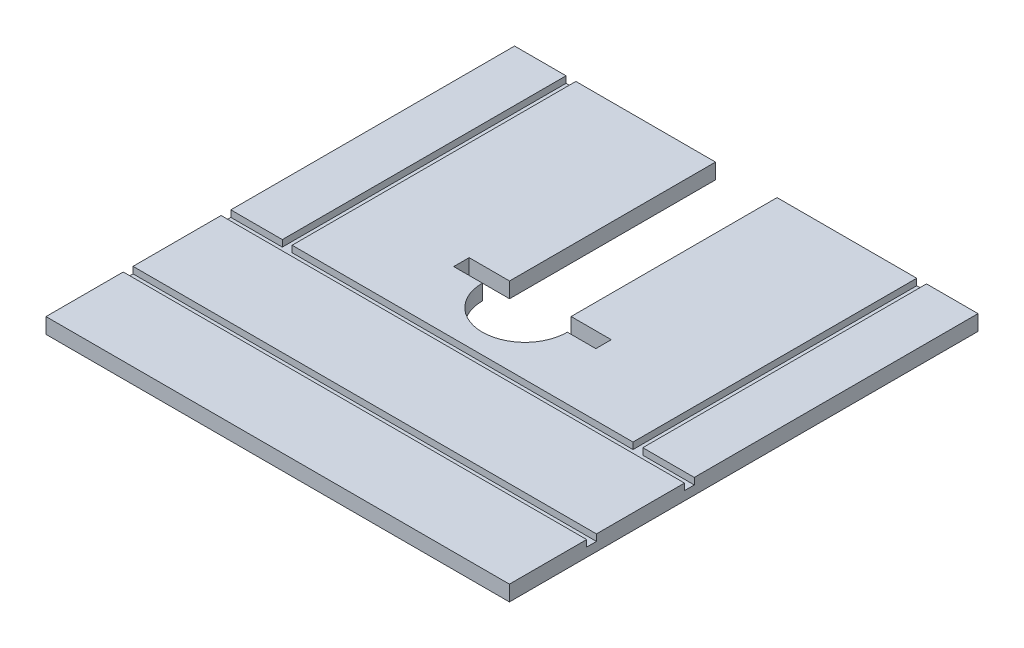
ISO-10303-21;
HEADER;
FILE_DESCRIPTION(('STEP AP214'),'2;1');
FILE_NAME('part.step','',(''),(''),'','','');
FILE_SCHEMA(('AUTOMOTIVE_DESIGN { 1 0 10303 214 1 1 1 1 }'));
ENDSEC;
DATA;
#1=APPLICATION_CONTEXT('core data for automotive mechanical design processes');
#2=APPLICATION_PROTOCOL_DEFINITION('international standard','automotive_design',2000,#1);
#3=PRODUCT_CONTEXT('',#1,'mechanical');
#4=PRODUCT('Part','Part','',(#3));
#5=PRODUCT_RELATED_PRODUCT_CATEGORY('part','',(#4));
#6=PRODUCT_DEFINITION_FORMATION('','',#4);
#7=PRODUCT_DEFINITION_CONTEXT('part definition',#1,'design');
#8=PRODUCT_DEFINITION('design','',#6,#7);
#9=PRODUCT_DEFINITION_SHAPE('','',#8);
#10=(LENGTH_UNIT() NAMED_UNIT(*) SI_UNIT(.MILLI.,.METRE.));
#11=(NAMED_UNIT(*) PLANE_ANGLE_UNIT() SI_UNIT($,.RADIAN.));
#12=(NAMED_UNIT(*) SI_UNIT($,.STERADIAN.) SOLID_ANGLE_UNIT());
#13=UNCERTAINTY_MEASURE_WITH_UNIT(LENGTH_MEASURE(1.E-05),#10,'distance_accuracy_value','');
#14=(GEOMETRIC_REPRESENTATION_CONTEXT(3) GLOBAL_UNCERTAINTY_ASSIGNED_CONTEXT((#13)) GLOBAL_UNIT_ASSIGNED_CONTEXT((#10,
#11,#12)) REPRESENTATION_CONTEXT('',''));
#15=CARTESIAN_POINT('',(0.,0.,0.));
#16=DIRECTION('',(0.,0.,1.));
#17=DIRECTION('',(1.,0.,0.));
#18=AXIS2_PLACEMENT_3D('',#15,#16,#17);
#19=CARTESIAN_POINT('',(0.,30.,0.));
#20=DIRECTION('',(0.,1.,0.));
#21=DIRECTION('',(0.,0.,1.));
#22=AXIS2_PLACEMENT_3D('',#19,#20,#21);
#23=PLANE('',#22);
#24=DIRECTION('',(-1.,0.,0.));
#25=VECTOR('',#24,1.);
#26=CARTESIAN_POINT('',(-450.,30.,121.));
#27=LINE('',#26,#25);
#28=CARTESIAN_POINT('',(-350.,30.,121.));
#29=VERTEX_POINT('',#28);
#30=CARTESIAN_POINT('',(-450.,30.,121.));
#31=VERTEX_POINT('',#30);
#32=EDGE_CURVE('E251',#29,#31,#27,.T.);
#33=ORIENTED_EDGE('',*,*,#32,.F.);
#34=DIRECTION('',(0.,0.,1.));
#35=VECTOR('',#34,1.);
#36=CARTESIAN_POINT('',(-350.,30.,-430.000000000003));
#37=LINE('',#36,#35);
#38=CARTESIAN_POINT('',(-350.,30.,-430.000000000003));
#39=VERTEX_POINT('',#38);
#40=EDGE_CURVE('E484',#39,#29,#37,.T.);
#41=ORIENTED_EDGE('',*,*,#40,.F.);
#42=DIRECTION('',(-1.,0.,0.));
#43=VECTOR('',#42,1.);
#44=CARTESIAN_POINT('',(-59.7765821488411,30.,-430.000000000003));
#45=LINE('',#44,#43);
#46=CARTESIAN_POINT('',(-450.,30.,-430.000000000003));
#47=VERTEX_POINT('',#46);
#48=EDGE_CURVE('E322',#39,#47,#45,.T.);
#49=ORIENTED_EDGE('',*,*,#48,.T.);
#50=DIRECTION('',(0.,0.,1.));
#51=VECTOR('',#50,1.);
#52=CARTESIAN_POINT('',(-450.,30.,-430.000000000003));
#53=LINE('',#52,#51);
#54=EDGE_CURVE('E289',#47,#31,#53,.T.);
#55=ORIENTED_EDGE('',*,*,#54,.T.);
#56=EDGE_LOOP('',(#33,#41,#49,#55));
#57=FACE_BOUND('',#56,.T.);
#58=ADVANCED_FACE('F32',(#57),#23,.T.);
#59=DIRECTION('',(0.,0.,-1.));
#60=VECTOR('',#59,1.);
#61=CARTESIAN_POINT('',(-331.,30.,121.));
#62=LINE('',#61,#60);
#63=CARTESIAN_POINT('',(-331.,30.,121.));
#64=VERTEX_POINT('',#63);
#65=CARTESIAN_POINT('',(-331.,30.,-430.000000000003));
#66=VERTEX_POINT('',#65);
#67=EDGE_CURVE('E482',#64,#66,#62,.T.);
#68=ORIENTED_EDGE('',*,*,#67,.F.);
#69=DIRECTION('',(-1.,0.,0.));
#70=VECTOR('',#69,1.);
#71=CARTESIAN_POINT('',(-331.,30.,121.));
#72=LINE('',#71,#70);
#73=CARTESIAN_POINT('',(331.,30.,121.));
#74=VERTEX_POINT('',#73);
#75=EDGE_CURVE('E479',#74,#64,#72,.T.);
#76=ORIENTED_EDGE('',*,*,#75,.F.);
#77=DIRECTION('',(0.,0.,1.));
#78=VECTOR('',#77,1.);
#79=CARTESIAN_POINT('',(331.,30.,121.));
#80=LINE('',#79,#78);
#81=CARTESIAN_POINT('',(331.,30.,-430.000000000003));
#82=VERTEX_POINT('',#81);
#83=EDGE_CURVE('E422',#82,#74,#80,.T.);
#84=ORIENTED_EDGE('',*,*,#83,.F.);
#85=DIRECTION('',(-1.,0.,0.));
#86=VECTOR('',#85,1.);
#87=CARTESIAN_POINT('',(450.,30.,-430.000000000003));
#88=LINE('',#87,#86);
#89=CARTESIAN_POINT('',(59.776582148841,30.,-430.000000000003));
#90=VERTEX_POINT('',#89);
#91=EDGE_CURVE('E299',#82,#90,#88,.T.);
#92=ORIENTED_EDGE('',*,*,#91,.T.);
#93=DIRECTION('',(0.,0.,1.));
#94=VECTOR('',#93,1.);
#95=CARTESIAN_POINT('',(59.776582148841,30.,-430.000000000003));
#96=LINE('',#95,#94);
#97=CARTESIAN_POINT('',(59.776582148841,30.,-30.000000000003));
#98=VERTEX_POINT('',#97);
#99=EDGE_CURVE('E304',#90,#98,#96,.T.);
#100=ORIENTED_EDGE('',*,*,#99,.T.);
#101=DIRECTION('',(1.,0.,0.));
#102=VECTOR('',#101,1.);
#103=CARTESIAN_POINT('',(59.776582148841,30.,-30.000000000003));
#104=LINE('',#103,#102);
#105=CARTESIAN_POINT('',(137.776582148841,30.,-30.000000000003));
#106=VERTEX_POINT('',#105);
#107=EDGE_CURVE('E306',#98,#106,#104,.T.);
#108=ORIENTED_EDGE('',*,*,#107,.T.);
#109=DIRECTION('',(0.,0.,1.));
#110=VECTOR('',#109,1.);
#111=CARTESIAN_POINT('',(137.776582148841,30.,-30.000000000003));
#112=LINE('',#111,#110);
#113=CARTESIAN_POINT('',(137.776582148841,30.,0.));
#114=VERTEX_POINT('',#113);
#115=EDGE_CURVE('E308',#106,#114,#112,.T.);
#116=ORIENTED_EDGE('',*,*,#115,.T.);
#117=DIRECTION('',(-1.,0.,0.));
#118=VECTOR('',#117,1.);
#119=CARTESIAN_POINT('',(137.776582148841,30.,0.));
#120=LINE('',#119,#118);
#121=CARTESIAN_POINT('',(82.5,30.,0.));
#122=VERTEX_POINT('',#121);
#123=EDGE_CURVE('E310',#114,#122,#120,.T.);
#124=ORIENTED_EDGE('',*,*,#123,.T.);
#125=CARTESIAN_POINT('',(0.,30.,0.));
#126=DIRECTION('',(0.,-1.,0.));
#127=DIRECTION('',(0.,0.,1.));
#128=AXIS2_PLACEMENT_3D('',#125,#126,#127);
#129=CIRCLE('',#128,82.5);
#130=CARTESIAN_POINT('',(-82.5,30.,0.));
#131=VERTEX_POINT('',#130);
#132=EDGE_CURVE('E312',#122,#131,#129,.T.);
#133=ORIENTED_EDGE('',*,*,#132,.T.);
#134=DIRECTION('',(-1.,0.,0.));
#135=VECTOR('',#134,1.);
#136=CARTESIAN_POINT('',(-138.223417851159,30.,0.));
#137=LINE('',#136,#135);
#138=CARTESIAN_POINT('',(-138.223417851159,30.,0.));
#139=VERTEX_POINT('',#138);
#140=EDGE_CURVE('E314',#131,#139,#137,.T.);
#141=ORIENTED_EDGE('',*,*,#140,.T.);
#142=DIRECTION('',(0.,0.,-1.));
#143=VECTOR('',#142,1.);
#144=CARTESIAN_POINT('',(-138.223417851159,30.,-30.000000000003));
#145=LINE('',#144,#143);
#146=CARTESIAN_POINT('',(-138.223417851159,30.,-30.000000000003));
#147=VERTEX_POINT('',#146);
#148=EDGE_CURVE('E316',#139,#147,#145,.T.);
#149=ORIENTED_EDGE('',*,*,#148,.T.);
#150=DIRECTION('',(1.,0.,0.));
#151=VECTOR('',#150,1.);
#152=CARTESIAN_POINT('',(-59.776582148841,30.,-30.0000000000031));
#153=LINE('',#152,#151);
#154=CARTESIAN_POINT('',(-59.776582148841,30.,-30.0000000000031));
#155=VERTEX_POINT('',#154);
#156=EDGE_CURVE('E318',#147,#155,#153,.T.);
#157=ORIENTED_EDGE('',*,*,#156,.T.);
#158=DIRECTION('',(0.,0.,-1.));
#159=VECTOR('',#158,1.);
#160=CARTESIAN_POINT('',(-59.7765821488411,30.,-430.000000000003));
#161=LINE('',#160,#159);
#162=CARTESIAN_POINT('',(-59.7765821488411,30.,-430.000000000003));
#163=VERTEX_POINT('',#162);
#164=EDGE_CURVE('E320',#155,#163,#161,.T.);
#165=ORIENTED_EDGE('',*,*,#164,.T.);
#166=EDGE_CURVE('E323',#163,#66,#45,.T.);
#167=ORIENTED_EDGE('',*,*,#166,.T.);
#168=EDGE_LOOP('',(#68,#76,#84,#92,#100,#108,#116,#124,#133,#141,#149,#157,#165,#167));
#169=FACE_BOUND('',#168,.T.);
#170=ADVANCED_FACE('F417',(#169),#23,.T.);
#171=DIRECTION('',(0.,0.,-1.));
#172=VECTOR('',#171,1.);
#173=CARTESIAN_POINT('',(350.,30.,-430.000000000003));
#174=LINE('',#173,#172);
#175=CARTESIAN_POINT('',(350.,30.,121.));
#176=VERTEX_POINT('',#175);
#177=CARTESIAN_POINT('',(350.,30.,-430.000000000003));
#178=VERTEX_POINT('',#177);
#179=EDGE_CURVE('E450',#176,#178,#174,.T.);
#180=ORIENTED_EDGE('',*,*,#179,.F.);
#181=DIRECTION('',(-1.,0.,0.));
#182=VECTOR('',#181,1.);
#183=CARTESIAN_POINT('',(350.,30.,121.));
#184=LINE('',#183,#182);
#185=CARTESIAN_POINT('',(450.,30.,121.));
#186=VERTEX_POINT('',#185);
#187=EDGE_CURVE('E444',#186,#176,#184,.T.);
#188=ORIENTED_EDGE('',*,*,#187,.F.);
#189=DIRECTION('',(0.,0.,-1.));
#190=VECTOR('',#189,1.);
#191=CARTESIAN_POINT('',(450.,30.,-430.000000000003));
#192=LINE('',#191,#190);
#193=CARTESIAN_POINT('',(450.,30.,-430.000000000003));
#194=VERTEX_POINT('',#193);
#195=EDGE_CURVE('E295',#186,#194,#192,.T.);
#196=ORIENTED_EDGE('',*,*,#195,.T.);
#197=EDGE_CURVE('E301',#194,#178,#88,.T.);
#198=ORIENTED_EDGE('',*,*,#197,.T.);
#199=EDGE_LOOP('',(#180,#188,#196,#198));
#200=FACE_BOUND('',#199,.T.);
#201=ADVANCED_FACE('F449',(#200),#23,.T.);
#202=DIRECTION('',(1.,0.,0.));
#203=VECTOR('',#202,1.);
#204=CARTESIAN_POINT('',(450.,30.,140.));
#205=LINE('',#204,#203);
#206=CARTESIAN_POINT('',(-450.,30.,140.));
#207=VERTEX_POINT('',#206);
#208=CARTESIAN_POINT('',(450.,30.,140.));
#209=VERTEX_POINT('',#208);
#210=EDGE_CURVE('E451',#207,#209,#205,.T.);
#211=ORIENTED_EDGE('',*,*,#210,.F.);
#212=CARTESIAN_POINT('',(-450.,30.,311.));
#213=VERTEX_POINT('',#212);
#214=EDGE_CURVE('E255',#207,#213,#53,.T.);
#215=ORIENTED_EDGE('',*,*,#214,.T.);
#216=DIRECTION('',(-1.,0.,0.));
#217=VECTOR('',#216,1.);
#218=CARTESIAN_POINT('',(-450.,30.,311.));
#219=LINE('',#218,#217);
#220=CARTESIAN_POINT('',(450.,30.,311.));
#221=VERTEX_POINT('',#220);
#222=EDGE_CURVE('E267',#221,#213,#219,.T.);
#223=ORIENTED_EDGE('',*,*,#222,.F.);
#224=EDGE_CURVE('E300',#221,#209,#192,.T.);
#225=ORIENTED_EDGE('',*,*,#224,.T.);
#226=EDGE_LOOP('',(#211,#215,#223,#225));
#227=FACE_BOUND('',#226,.T.);
#228=ADVANCED_FACE('F457',(#227),#23,.T.);
#229=CARTESIAN_POINT('',(-450.,30.,-430.000000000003));
#230=DIRECTION('',(1.,0.,0.));
#231=DIRECTION('',(0.,0.,-1.));
#232=AXIS2_PLACEMENT_3D('',#229,#230,#231);
#233=PLANE('',#232);
#234=DIRECTION('',(0.,0.,1.));
#235=VECTOR('',#234,1.);
#236=CARTESIAN_POINT('',(-450.,17.3,140.));
#237=LINE('',#236,#235);
#238=CARTESIAN_POINT('',(-450.,17.3,121.));
#239=VERTEX_POINT('',#238);
#240=CARTESIAN_POINT('',(-450.,17.3,140.));
#241=VERTEX_POINT('',#240);
#242=EDGE_CURVE('E241',#239,#241,#237,.T.);
#243=ORIENTED_EDGE('',*,*,#242,.F.);
#244=DIRECTION('',(0.,1.,0.));
#245=VECTOR('',#244,1.);
#246=CARTESIAN_POINT('',(-450.,17.3,121.));
#247=LINE('',#246,#245);
#248=EDGE_CURVE('E277',#239,#31,#247,.T.);
#249=ORIENTED_EDGE('',*,*,#248,.T.);
#250=ORIENTED_EDGE('',*,*,#54,.F.);
#251=DIRECTION('',(0.,-1.,0.));
#252=VECTOR('',#251,1.);
#253=CARTESIAN_POINT('',(-450.,30.,-430.000000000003));
#254=LINE('',#253,#252);
#255=CARTESIAN_POINT('',(-450.,0.,-430.000000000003));
#256=VERTEX_POINT('',#255);
#257=EDGE_CURVE('E326',#47,#256,#254,.T.);
#258=ORIENTED_EDGE('',*,*,#257,.T.);
#259=DIRECTION('',(0.,0.,1.));
#260=VECTOR('',#259,1.);
#261=CARTESIAN_POINT('',(-450.,0.,-430.000000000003));
#262=LINE('',#261,#260);
#263=CARTESIAN_POINT('',(-450.,0.,480.));
#264=VERTEX_POINT('',#263);
#265=EDGE_CURVE('E282',#256,#264,#262,.T.);
#266=ORIENTED_EDGE('',*,*,#265,.T.);
#267=DIRECTION('',(0.,-1.,0.));
#268=VECTOR('',#267,1.);
#269=CARTESIAN_POINT('',(-450.,30.,480.));
#270=LINE('',#269,#268);
#271=CARTESIAN_POINT('',(-450.,30.,480.));
#272=VERTEX_POINT('',#271);
#273=EDGE_CURVE('E11',#272,#264,#270,.T.);
#274=ORIENTED_EDGE('',*,*,#273,.F.);
#275=CARTESIAN_POINT('',(-450.,30.,330.));
#276=VERTEX_POINT('',#275);
#277=EDGE_CURVE('E293',#276,#272,#53,.T.);
#278=ORIENTED_EDGE('',*,*,#277,.F.);
#279=DIRECTION('',(0.,1.,0.));
#280=VECTOR('',#279,1.);
#281=CARTESIAN_POINT('',(-450.,17.3,330.));
#282=LINE('',#281,#280);
#283=CARTESIAN_POINT('',(-450.,17.3,330.));
#284=VERTEX_POINT('',#283);
#285=EDGE_CURVE('E55',#284,#276,#282,.T.);
#286=ORIENTED_EDGE('',*,*,#285,.F.);
#287=DIRECTION('',(0.,0.,1.));
#288=VECTOR('',#287,1.);
#289=CARTESIAN_POINT('',(-450.,17.3,330.));
#290=LINE('',#289,#288);
#291=CARTESIAN_POINT('',(-450.,17.3,311.));
#292=VERTEX_POINT('',#291);
#293=EDGE_CURVE('E263',#292,#284,#290,.T.);
#294=ORIENTED_EDGE('',*,*,#293,.F.);
#295=DIRECTION('',(0.,1.,0.));
#296=VECTOR('',#295,1.);
#297=CARTESIAN_POINT('',(-450.,17.3,311.));
#298=LINE('',#297,#296);
#299=EDGE_CURVE('E280',#292,#213,#298,.T.);
#300=ORIENTED_EDGE('',*,*,#299,.T.);
#301=ORIENTED_EDGE('',*,*,#214,.F.);
#302=DIRECTION('',(0.,1.,0.));
#303=VECTOR('',#302,1.);
#304=CARTESIAN_POINT('',(-450.,17.3,140.));
#305=LINE('',#304,#303);
#306=EDGE_CURVE('E234',#241,#207,#305,.T.);
#307=ORIENTED_EDGE('',*,*,#306,.F.);
#308=EDGE_LOOP('',(#243,#249,#250,#258,#266,#274,#278,#286,#294,#300,#301,#307));
#309=FACE_BOUND('',#308,.T.);
#310=ADVANCED_FACE('F34',(#309),#233,.F.);
#311=CARTESIAN_POINT('',(450.,30.,480.));
#312=DIRECTION('',(0.,0.,-1.));
#313=DIRECTION('',(-1.,0.,0.));
#314=AXIS2_PLACEMENT_3D('',#311,#312,#313);
#315=PLANE('',#314);
#316=DIRECTION('',(1.,0.,0.));
#317=VECTOR('',#316,1.);
#318=CARTESIAN_POINT('',(450.,0.,480.));
#319=LINE('',#318,#317);
#320=CARTESIAN_POINT('',(450.,0.,480.));
#321=VERTEX_POINT('',#320);
#322=EDGE_CURVE('E329',#264,#321,#319,.T.);
#323=ORIENTED_EDGE('',*,*,#322,.T.);
#324=DIRECTION('',(0.,-1.,0.));
#325=VECTOR('',#324,1.);
#326=CARTESIAN_POINT('',(450.,30.,480.));
#327=LINE('',#326,#325);
#328=CARTESIAN_POINT('',(450.,30.,480.));
#329=VERTEX_POINT('',#328);
#330=EDGE_CURVE('E40',#329,#321,#327,.T.);
#331=ORIENTED_EDGE('',*,*,#330,.F.);
#332=DIRECTION('',(1.,0.,0.));
#333=VECTOR('',#332,1.);
#334=CARTESIAN_POINT('',(450.,30.,480.));
#335=LINE('',#334,#333);
#336=EDGE_CURVE('E292',#272,#329,#335,.T.);
#337=ORIENTED_EDGE('',*,*,#336,.F.);
#338=ORIENTED_EDGE('',*,*,#273,.T.);
#339=EDGE_LOOP('',(#323,#331,#337,#338));
#340=FACE_BOUND('',#339,.T.);
#341=ADVANCED_FACE('F582',(#340),#315,.F.);
#342=CARTESIAN_POINT('',(450.,30.,-430.000000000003));
#343=DIRECTION('',(-1.,0.,0.));
#344=DIRECTION('',(0.,0.,1.));
#345=AXIS2_PLACEMENT_3D('',#342,#343,#344);
#346=PLANE('',#345);
#347=ORIENTED_EDGE('',*,*,#195,.F.);
#348=DIRECTION('',(0.,1.,0.));
#349=VECTOR('',#348,1.);
#350=CARTESIAN_POINT('',(450.,17.3,121.));
#351=LINE('',#350,#349);
#352=CARTESIAN_POINT('',(450.,17.3,121.));
#353=VERTEX_POINT('',#352);
#354=EDGE_CURVE('E257',#353,#186,#351,.T.);
#355=ORIENTED_EDGE('',*,*,#354,.F.);
#356=DIRECTION('',(0.,0.,-1.));
#357=VECTOR('',#356,1.);
#358=CARTESIAN_POINT('',(450.,17.3,121.));
#359=LINE('',#358,#357);
#360=CARTESIAN_POINT('',(450.,17.3,140.));
#361=VERTEX_POINT('',#360);
#362=EDGE_CURVE('E240',#361,#353,#359,.T.);
#363=ORIENTED_EDGE('',*,*,#362,.F.);
#364=DIRECTION('',(0.,1.,0.));
#365=VECTOR('',#364,1.);
#366=CARTESIAN_POINT('',(450.,17.3,140.));
#367=LINE('',#366,#365);
#368=EDGE_CURVE('E237',#361,#209,#367,.T.);
#369=ORIENTED_EDGE('',*,*,#368,.T.);
#370=ORIENTED_EDGE('',*,*,#224,.F.);
#371=DIRECTION('',(0.,1.,0.));
#372=VECTOR('',#371,1.);
#373=CARTESIAN_POINT('',(450.,17.3,311.));
#374=LINE('',#373,#372);
#375=CARTESIAN_POINT('',(450.,17.3,311.));
#376=VERTEX_POINT('',#375);
#377=EDGE_CURVE('E283',#376,#221,#374,.T.);
#378=ORIENTED_EDGE('',*,*,#377,.F.);
#379=DIRECTION('',(0.,0.,-1.));
#380=VECTOR('',#379,1.);
#381=CARTESIAN_POINT('',(450.,17.3,311.));
#382=LINE('',#381,#380);
#383=CARTESIAN_POINT('',(450.,17.3,330.));
#384=VERTEX_POINT('',#383);
#385=EDGE_CURVE('E270',#384,#376,#382,.T.);
#386=ORIENTED_EDGE('',*,*,#385,.F.);
#387=DIRECTION('',(0.,1.,0.));
#388=VECTOR('',#387,1.);
#389=CARTESIAN_POINT('',(450.,17.3,330.));
#390=LINE('',#389,#388);
#391=CARTESIAN_POINT('',(450.,30.,330.));
#392=VERTEX_POINT('',#391);
#393=EDGE_CURVE('E285',#384,#392,#390,.T.);
#394=ORIENTED_EDGE('',*,*,#393,.T.);
#395=EDGE_CURVE('E296',#329,#392,#192,.T.);
#396=ORIENTED_EDGE('',*,*,#395,.F.);
#397=ORIENTED_EDGE('',*,*,#330,.T.);
#398=DIRECTION('',(0.,0.,-1.));
#399=VECTOR('',#398,1.);
#400=CARTESIAN_POINT('',(450.,0.,-430.000000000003));
#401=LINE('',#400,#399);
#402=CARTESIAN_POINT('',(450.,0.,-430.000000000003));
#403=VERTEX_POINT('',#402);
#404=EDGE_CURVE('E331',#321,#403,#401,.T.);
#405=ORIENTED_EDGE('',*,*,#404,.T.);
#406=DIRECTION('',(0.,-1.,0.));
#407=VECTOR('',#406,1.);
#408=CARTESIAN_POINT('',(450.,30.,-430.000000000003));
#409=LINE('',#408,#407);
#410=EDGE_CURVE('E387',#194,#403,#409,.T.);
#411=ORIENTED_EDGE('',*,*,#410,.F.);
#412=EDGE_LOOP('',(#347,#355,#363,#369,#370,#378,#386,#394,#396,#397,#405,#411));
#413=FACE_BOUND('',#412,.T.);
#414=ADVANCED_FACE('F395',(#413),#346,.F.);
#415=CARTESIAN_POINT('',(450.,30.,-430.000000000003));
#416=DIRECTION('',(0.,0.,1.));
#417=DIRECTION('',(1.,0.,0.));
#418=AXIS2_PLACEMENT_3D('',#415,#416,#417);
#419=PLANE('',#418);
#420=ORIENTED_EDGE('',*,*,#91,.F.);
#421=DIRECTION('',(0.,1.,0.));
#422=VECTOR('',#421,1.);
#423=CARTESIAN_POINT('',(331.,17.3,-430.000000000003));
#424=LINE('',#423,#422);
#425=CARTESIAN_POINT('',(331.,17.3,-430.000000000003));
#426=VERTEX_POINT('',#425);
#427=EDGE_CURVE('E425',#426,#82,#424,.T.);
#428=ORIENTED_EDGE('',*,*,#427,.F.);
#429=DIRECTION('',(-1.,0.,0.));
#430=VECTOR('',#429,1.);
#431=CARTESIAN_POINT('',(331.,17.3,-430.000000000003));
#432=LINE('',#431,#430);
#433=CARTESIAN_POINT('',(350.,17.3,-430.000000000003));
#434=VERTEX_POINT('',#433);
#435=EDGE_CURVE('E428',#434,#426,#432,.T.);
#436=ORIENTED_EDGE('',*,*,#435,.F.);
#437=DIRECTION('',(0.,1.,0.));
#438=VECTOR('',#437,1.);
#439=CARTESIAN_POINT('',(350.,17.3,-430.000000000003));
#440=LINE('',#439,#438);
#441=EDGE_CURVE('E431',#434,#178,#440,.T.);
#442=ORIENTED_EDGE('',*,*,#441,.T.);
#443=ORIENTED_EDGE('',*,*,#197,.F.);
#444=ORIENTED_EDGE('',*,*,#410,.T.);
#445=DIRECTION('',(-1.,0.,0.));
#446=VECTOR('',#445,1.);
#447=CARTESIAN_POINT('',(450.,0.,-430.000000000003));
#448=LINE('',#447,#446);
#449=CARTESIAN_POINT('',(59.776582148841,0.,-430.000000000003));
#450=VERTEX_POINT('',#449);
#451=EDGE_CURVE('E333',#403,#450,#448,.T.);
#452=ORIENTED_EDGE('',*,*,#451,.T.);
#453=DIRECTION('',(0.,-1.,0.));
#454=VECTOR('',#453,1.);
#455=CARTESIAN_POINT('',(59.776582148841,30.,-430.000000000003));
#456=LINE('',#455,#454);
#457=EDGE_CURVE('E384',#90,#450,#456,.T.);
#458=ORIENTED_EDGE('',*,*,#457,.F.);
#459=EDGE_LOOP('',(#420,#428,#436,#442,#443,#444,#452,#458));
#460=FACE_BOUND('',#459,.T.);
#461=ADVANCED_FACE('F408',(#460),#419,.F.);
#462=CARTESIAN_POINT('',(59.776582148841,30.,-430.000000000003));
#463=DIRECTION('',(1.,0.,0.));
#464=DIRECTION('',(0.,0.,-1.));
#465=AXIS2_PLACEMENT_3D('',#462,#463,#464);
#466=PLANE('',#465);
#467=DIRECTION('',(0.,0.,1.));
#468=VECTOR('',#467,1.);
#469=CARTESIAN_POINT('',(59.776582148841,0.,-430.000000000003));
#470=LINE('',#469,#468);
#471=CARTESIAN_POINT('',(59.776582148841,0.,-30.000000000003));
#472=VERTEX_POINT('',#471);
#473=EDGE_CURVE('E335',#450,#472,#470,.T.);
#474=ORIENTED_EDGE('',*,*,#473,.T.);
#475=DIRECTION('',(0.,-1.,0.));
#476=VECTOR('',#475,1.);
#477=CARTESIAN_POINT('',(59.776582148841,30.,-30.000000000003));
#478=LINE('',#477,#476);
#479=EDGE_CURVE('E381',#98,#472,#478,.T.);
#480=ORIENTED_EDGE('',*,*,#479,.F.);
#481=ORIENTED_EDGE('',*,*,#99,.F.);
#482=ORIENTED_EDGE('',*,*,#457,.T.);
#483=EDGE_LOOP('',(#474,#480,#481,#482));
#484=FACE_BOUND('',#483,.T.);
#485=ADVANCED_FACE('F412',(#484),#466,.F.);
#486=CARTESIAN_POINT('',(59.776582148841,30.,-30.000000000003));
#487=DIRECTION('',(0.,0.,-1.));
#488=DIRECTION('',(-1.,0.,0.));
#489=AXIS2_PLACEMENT_3D('',#486,#487,#488);
#490=PLANE('',#489);
#491=DIRECTION('',(1.,0.,0.));
#492=VECTOR('',#491,1.);
#493=CARTESIAN_POINT('',(59.776582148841,0.,-30.000000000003));
#494=LINE('',#493,#492);
#495=CARTESIAN_POINT('',(137.776582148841,0.,-30.000000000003));
#496=VERTEX_POINT('',#495);
#497=EDGE_CURVE('E337',#472,#496,#494,.T.);
#498=ORIENTED_EDGE('',*,*,#497,.T.);
#499=DIRECTION('',(0.,-1.,0.));
#500=VECTOR('',#499,1.);
#501=CARTESIAN_POINT('',(137.776582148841,30.,-30.000000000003));
#502=LINE('',#501,#500);
#503=EDGE_CURVE('E378',#106,#496,#502,.T.);
#504=ORIENTED_EDGE('',*,*,#503,.F.);
#505=ORIENTED_EDGE('',*,*,#107,.F.);
#506=ORIENTED_EDGE('',*,*,#479,.T.);
#507=EDGE_LOOP('',(#498,#504,#505,#506));
#508=FACE_BOUND('',#507,.T.);
#509=ADVANCED_FACE('F552',(#508),#490,.F.);
#510=CARTESIAN_POINT('',(137.776582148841,30.,-30.000000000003));
#511=DIRECTION('',(1.,0.,0.));
#512=DIRECTION('',(0.,0.,-1.));
#513=AXIS2_PLACEMENT_3D('',#510,#511,#512);
#514=PLANE('',#513);
#515=DIRECTION('',(0.,0.,1.));
#516=VECTOR('',#515,1.);
#517=CARTESIAN_POINT('',(137.776582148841,0.,-30.000000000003));
#518=LINE('',#517,#516);
#519=CARTESIAN_POINT('',(137.776582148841,0.,0.));
#520=VERTEX_POINT('',#519);
#521=EDGE_CURVE('E339',#496,#520,#518,.T.);
#522=ORIENTED_EDGE('',*,*,#521,.T.);
#523=DIRECTION('',(0.,-1.,0.));
#524=VECTOR('',#523,1.);
#525=CARTESIAN_POINT('',(137.776582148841,30.,0.));
#526=LINE('',#525,#524);
#527=EDGE_CURVE('E375',#114,#520,#526,.T.);
#528=ORIENTED_EDGE('',*,*,#527,.F.);
#529=ORIENTED_EDGE('',*,*,#115,.F.);
#530=ORIENTED_EDGE('',*,*,#503,.T.);
#531=EDGE_LOOP('',(#522,#528,#529,#530));
#532=FACE_BOUND('',#531,.T.);
#533=ADVANCED_FACE('F549',(#532),#514,.F.);
#534=CARTESIAN_POINT('',(137.776582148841,30.,0.));
#535=DIRECTION('',(0.,0.,1.));
#536=DIRECTION('',(1.,0.,0.));
#537=AXIS2_PLACEMENT_3D('',#534,#535,#536);
#538=PLANE('',#537);
#539=DIRECTION('',(-1.,0.,0.));
#540=VECTOR('',#539,1.);
#541=CARTESIAN_POINT('',(137.776582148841,0.,0.));
#542=LINE('',#541,#540);
#543=CARTESIAN_POINT('',(82.5,0.,0.));
#544=VERTEX_POINT('',#543);
#545=EDGE_CURVE('E341',#520,#544,#542,.T.);
#546=ORIENTED_EDGE('',*,*,#545,.T.);
#547=DIRECTION('',(0.,-1.,0.));
#548=VECTOR('',#547,1.);
#549=CARTESIAN_POINT('',(82.5,30.,0.));
#550=LINE('',#549,#548);
#551=EDGE_CURVE('E372',#122,#544,#550,.T.);
#552=ORIENTED_EDGE('',*,*,#551,.F.);
#553=ORIENTED_EDGE('',*,*,#123,.F.);
#554=ORIENTED_EDGE('',*,*,#527,.T.);
#555=EDGE_LOOP('',(#546,#552,#553,#554));
#556=FACE_BOUND('',#555,.T.);
#557=ADVANCED_FACE('F545',(#556),#538,.F.);
#558=CARTESIAN_POINT('',(0.,30.,0.));
#559=DIRECTION('',(0.,-1.,0.));
#560=DIRECTION('',(0.,0.,-1.));
#561=AXIS2_PLACEMENT_3D('',#558,#559,#560);
#562=CYLINDRICAL_SURFACE('',#561,82.5);
#563=CARTESIAN_POINT('',(0.,0.,0.));
#564=DIRECTION('',(0.,-1.,0.));
#565=DIRECTION('',(0.,0.,1.));
#566=AXIS2_PLACEMENT_3D('',#563,#564,#565);
#567=CIRCLE('',#566,82.5);
#568=CARTESIAN_POINT('',(-82.5,0.,0.));
#569=VERTEX_POINT('',#568);
#570=EDGE_CURVE('E343',#544,#569,#567,.T.);
#571=ORIENTED_EDGE('',*,*,#570,.T.);
#572=DIRECTION('',(0.,-1.,0.));
#573=VECTOR('',#572,1.);
#574=CARTESIAN_POINT('',(-82.5,30.,0.));
#575=LINE('',#574,#573);
#576=EDGE_CURVE('E369',#131,#569,#575,.T.);
#577=ORIENTED_EDGE('',*,*,#576,.F.);
#578=ORIENTED_EDGE('',*,*,#132,.F.);
#579=ORIENTED_EDGE('',*,*,#551,.T.);
#580=EDGE_LOOP('',(#571,#577,#578,#579));
#581=FACE_BOUND('',#580,.T.);
#582=ADVANCED_FACE('F541',(#581),#562,.F.);
#583=CARTESIAN_POINT('',(-138.223417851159,30.,0.));
#584=DIRECTION('',(0.,0.,1.));
#585=DIRECTION('',(1.,0.,0.));
#586=AXIS2_PLACEMENT_3D('',#583,#584,#585);
#587=PLANE('',#586);
#588=DIRECTION('',(-1.,0.,0.));
#589=VECTOR('',#588,1.);
#590=CARTESIAN_POINT('',(-138.223417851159,0.,0.));
#591=LINE('',#590,#589);
#592=CARTESIAN_POINT('',(-138.223417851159,0.,0.));
#593=VERTEX_POINT('',#592);
#594=EDGE_CURVE('E345',#569,#593,#591,.T.);
#595=ORIENTED_EDGE('',*,*,#594,.T.);
#596=DIRECTION('',(0.,-1.,0.));
#597=VECTOR('',#596,1.);
#598=CARTESIAN_POINT('',(-138.223417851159,30.,0.));
#599=LINE('',#598,#597);
#600=EDGE_CURVE('E366',#139,#593,#599,.T.);
#601=ORIENTED_EDGE('',*,*,#600,.F.);
#602=ORIENTED_EDGE('',*,*,#140,.F.);
#603=ORIENTED_EDGE('',*,*,#576,.T.);
#604=EDGE_LOOP('',(#595,#601,#602,#603));
#605=FACE_BOUND('',#604,.T.);
#606=ADVANCED_FACE('F536',(#605),#587,.F.);
#607=CARTESIAN_POINT('',(-138.223417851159,30.,-30.000000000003));
#608=DIRECTION('',(-1.,0.,0.));
#609=DIRECTION('',(0.,0.,1.));
#610=AXIS2_PLACEMENT_3D('',#607,#608,#609);
#611=PLANE('',#610);
#612=DIRECTION('',(0.,0.,-1.));
#613=VECTOR('',#612,1.);
#614=CARTESIAN_POINT('',(-138.223417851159,0.,-30.000000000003));
#615=LINE('',#614,#613);
#616=CARTESIAN_POINT('',(-138.223417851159,0.,-30.000000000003));
#617=VERTEX_POINT('',#616);
#618=EDGE_CURVE('E347',#593,#617,#615,.T.);
#619=ORIENTED_EDGE('',*,*,#618,.T.);
#620=DIRECTION('',(0.,-1.,0.));
#621=VECTOR('',#620,1.);
#622=CARTESIAN_POINT('',(-138.223417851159,30.,-30.000000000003));
#623=LINE('',#622,#621);
#624=EDGE_CURVE('E363',#147,#617,#623,.T.);
#625=ORIENTED_EDGE('',*,*,#624,.F.);
#626=ORIENTED_EDGE('',*,*,#148,.F.);
#627=ORIENTED_EDGE('',*,*,#600,.T.);
#628=EDGE_LOOP('',(#619,#625,#626,#627));
#629=FACE_BOUND('',#628,.T.);
#630=ADVANCED_FACE('F530',(#629),#611,.F.);
#631=CARTESIAN_POINT('',(-59.776582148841,30.,-30.0000000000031));
#632=DIRECTION('',(0.,0.,-1.));
#633=DIRECTION('',(-1.,0.,0.));
#634=AXIS2_PLACEMENT_3D('',#631,#632,#633);
#635=PLANE('',#634);
#636=DIRECTION('',(1.,0.,0.));
#637=VECTOR('',#636,1.);
#638=CARTESIAN_POINT('',(-59.776582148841,0.,-30.0000000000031));
#639=LINE('',#638,#637);
#640=CARTESIAN_POINT('',(-59.776582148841,0.,-30.0000000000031));
#641=VERTEX_POINT('',#640);
#642=EDGE_CURVE('E349',#617,#641,#639,.T.);
#643=ORIENTED_EDGE('',*,*,#642,.T.);
#644=DIRECTION('',(0.,-1.,0.));
#645=VECTOR('',#644,1.);
#646=CARTESIAN_POINT('',(-59.776582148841,30.,-30.0000000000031));
#647=LINE('',#646,#645);
#648=EDGE_CURVE('E360',#155,#641,#647,.T.);
#649=ORIENTED_EDGE('',*,*,#648,.F.);
#650=ORIENTED_EDGE('',*,*,#156,.F.);
#651=ORIENTED_EDGE('',*,*,#624,.T.);
#652=EDGE_LOOP('',(#643,#649,#650,#651));
#653=FACE_BOUND('',#652,.T.);
#654=ADVANCED_FACE('F526',(#653),#635,.F.);
#655=CARTESIAN_POINT('',(-59.7765821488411,30.,-430.000000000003));
#656=DIRECTION('',(-1.,0.,0.));
#657=DIRECTION('',(0.,0.,1.));
#658=AXIS2_PLACEMENT_3D('',#655,#656,#657);
#659=PLANE('',#658);
#660=DIRECTION('',(0.,0.,-1.));
#661=VECTOR('',#660,1.);
#662=CARTESIAN_POINT('',(-59.7765821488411,0.,-430.000000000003));
#663=LINE('',#662,#661);
#664=CARTESIAN_POINT('',(-59.7765821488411,0.,-430.000000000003));
#665=VERTEX_POINT('',#664);
#666=EDGE_CURVE('E351',#641,#665,#663,.T.);
#667=ORIENTED_EDGE('',*,*,#666,.T.);
#668=DIRECTION('',(0.,-1.,0.));
#669=VECTOR('',#668,1.);
#670=CARTESIAN_POINT('',(-59.7765821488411,30.,-430.000000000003));
#671=LINE('',#670,#669);
#672=EDGE_CURVE('E357',#163,#665,#671,.T.);
#673=ORIENTED_EDGE('',*,*,#672,.F.);
#674=ORIENTED_EDGE('',*,*,#164,.F.);
#675=ORIENTED_EDGE('',*,*,#648,.T.);
#676=EDGE_LOOP('',(#667,#673,#674,#675));
#677=FACE_BOUND('',#676,.T.);
#678=ADVANCED_FACE('F522',(#677),#659,.F.);
#679=CARTESIAN_POINT('',(-59.7765821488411,30.,-430.000000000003));
#680=DIRECTION('',(0.,0.,1.));
#681=DIRECTION('',(1.,0.,0.));
#682=AXIS2_PLACEMENT_3D('',#679,#680,#681);
#683=PLANE('',#682);
#684=ORIENTED_EDGE('',*,*,#48,.F.);
#685=DIRECTION('',(0.,1.,0.));
#686=VECTOR('',#685,1.);
#687=CARTESIAN_POINT('',(-350.,17.3,-430.000000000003));
#688=LINE('',#687,#686);
#689=CARTESIAN_POINT('',(-350.,17.3,-430.000000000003));
#690=VERTEX_POINT('',#689);
#691=EDGE_CURVE('E491',#690,#39,#688,.T.);
#692=ORIENTED_EDGE('',*,*,#691,.F.);
#693=DIRECTION('',(-1.,0.,0.));
#694=VECTOR('',#693,1.);
#695=CARTESIAN_POINT('',(-331.,17.3,-430.000000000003));
#696=LINE('',#695,#694);
#697=CARTESIAN_POINT('',(-331.,17.3,-430.000000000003));
#698=VERTEX_POINT('',#697);
#699=EDGE_CURVE('E473',#698,#690,#696,.T.);
#700=ORIENTED_EDGE('',*,*,#699,.F.);
#701=DIRECTION('',(0.,1.,0.));
#702=VECTOR('',#701,1.);
#703=CARTESIAN_POINT('',(-331.,17.3,-430.000000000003));
#704=LINE('',#703,#702);
#705=EDGE_CURVE('E493',#698,#66,#704,.T.);
#706=ORIENTED_EDGE('',*,*,#705,.T.);
#707=ORIENTED_EDGE('',*,*,#166,.F.);
#708=ORIENTED_EDGE('',*,*,#672,.T.);
#709=DIRECTION('',(-1.,0.,0.));
#710=VECTOR('',#709,1.);
#711=CARTESIAN_POINT('',(-59.7765821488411,0.,-430.000000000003));
#712=LINE('',#711,#710);
#713=EDGE_CURVE('E353',#665,#256,#712,.T.);
#714=ORIENTED_EDGE('',*,*,#713,.T.);
#715=ORIENTED_EDGE('',*,*,#257,.F.);
#716=EDGE_LOOP('',(#684,#692,#700,#706,#707,#708,#714,#715));
#717=FACE_BOUND('',#716,.T.);
#718=ADVANCED_FACE('F505',(#717),#683,.F.);
#719=DIRECTION('',(1.,0.,0.));
#720=VECTOR('',#719,1.);
#721=CARTESIAN_POINT('',(450.,30.,330.));
#722=LINE('',#721,#720);
#723=EDGE_CURVE('E275',#276,#392,#722,.T.);
#724=ORIENTED_EDGE('',*,*,#723,.F.);
#725=ORIENTED_EDGE('',*,*,#277,.T.);
#726=ORIENTED_EDGE('',*,*,#336,.T.);
#727=ORIENTED_EDGE('',*,*,#395,.T.);
#728=EDGE_LOOP('',(#724,#725,#726,#727));
#729=FACE_BOUND('',#728,.T.);
#730=ADVANCED_FACE('F563',(#729),#23,.T.);
#731=CARTESIAN_POINT('',(0.,0.,0.));
#732=DIRECTION('',(0.,1.,0.));
#733=DIRECTION('',(0.,0.,1.));
#734=AXIS2_PLACEMENT_3D('',#731,#732,#733);
#735=PLANE('',#734);
#736=ORIENTED_EDGE('',*,*,#265,.F.);
#737=ORIENTED_EDGE('',*,*,#713,.F.);
#738=ORIENTED_EDGE('',*,*,#666,.F.);
#739=ORIENTED_EDGE('',*,*,#642,.F.);
#740=ORIENTED_EDGE('',*,*,#618,.F.);
#741=ORIENTED_EDGE('',*,*,#594,.F.);
#742=ORIENTED_EDGE('',*,*,#570,.F.);
#743=ORIENTED_EDGE('',*,*,#545,.F.);
#744=ORIENTED_EDGE('',*,*,#521,.F.);
#745=ORIENTED_EDGE('',*,*,#497,.F.);
#746=ORIENTED_EDGE('',*,*,#473,.F.);
#747=ORIENTED_EDGE('',*,*,#451,.F.);
#748=ORIENTED_EDGE('',*,*,#404,.F.);
#749=ORIENTED_EDGE('',*,*,#322,.F.);
#750=EDGE_LOOP('',(#736,#737,#738,#739,#740,#741,#742,#743,#744,#745,#746,#747,#748,#749));
#751=FACE_BOUND('',#750,.T.);
#752=ADVANCED_FACE('F402',(#751),#735,.F.);
#753=CARTESIAN_POINT('',(-450.,17.3,311.));
#754=DIRECTION('',(0.,0.,-1.));
#755=DIRECTION('',(-1.,0.,0.));
#756=AXIS2_PLACEMENT_3D('',#753,#754,#755);
#757=PLANE('',#756);
#758=ORIENTED_EDGE('',*,*,#222,.T.);
#759=ORIENTED_EDGE('',*,*,#299,.F.);
#760=DIRECTION('',(-1.,0.,0.));
#761=VECTOR('',#760,1.);
#762=CARTESIAN_POINT('',(-450.,17.3,311.));
#763=LINE('',#762,#761);
#764=EDGE_CURVE('E272',#376,#292,#763,.T.);
#765=ORIENTED_EDGE('',*,*,#764,.F.);
#766=ORIENTED_EDGE('',*,*,#377,.T.);
#767=EDGE_LOOP('',(#758,#759,#765,#766));
#768=FACE_BOUND('',#767,.T.);
#769=ADVANCED_FACE('F575',(#768),#757,.F.);
#770=CARTESIAN_POINT('',(450.,17.3,330.));
#771=DIRECTION('',(0.,0.,1.));
#772=DIRECTION('',(1.,0.,0.));
#773=AXIS2_PLACEMENT_3D('',#770,#771,#772);
#774=PLANE('',#773);
#775=ORIENTED_EDGE('',*,*,#723,.T.);
#776=ORIENTED_EDGE('',*,*,#393,.F.);
#777=DIRECTION('',(1.,0.,0.));
#778=VECTOR('',#777,1.);
#779=CARTESIAN_POINT('',(450.,17.3,330.));
#780=LINE('',#779,#778);
#781=EDGE_CURVE('E266',#284,#384,#780,.T.);
#782=ORIENTED_EDGE('',*,*,#781,.F.);
#783=ORIENTED_EDGE('',*,*,#285,.T.);
#784=EDGE_LOOP('',(#775,#776,#782,#783));
#785=FACE_BOUND('',#784,.T.);
#786=ADVANCED_FACE('F707',(#785),#774,.F.);
#787=CARTESIAN_POINT('',(0.,17.3,0.));
#788=DIRECTION('',(0.,-1.,0.));
#789=DIRECTION('',(0.,0.,-1.));
#790=AXIS2_PLACEMENT_3D('',#787,#788,#789);
#791=PLANE('',#790);
#792=ORIENTED_EDGE('',*,*,#293,.T.);
#793=ORIENTED_EDGE('',*,*,#781,.T.);
#794=ORIENTED_EDGE('',*,*,#385,.T.);
#795=ORIENTED_EDGE('',*,*,#764,.T.);
#796=EDGE_LOOP('',(#792,#793,#794,#795));
#797=FACE_BOUND('',#796,.T.);
#798=ADVANCED_FACE('F717',(#797),#791,.F.);
#799=CARTESIAN_POINT('',(-450.,17.3,121.));
#800=DIRECTION('',(0.,0.,-1.));
#801=DIRECTION('',(-1.,0.,0.));
#802=AXIS2_PLACEMENT_3D('',#799,#800,#801);
#803=PLANE('',#802);
#804=ORIENTED_EDGE('',*,*,#32,.T.);
#805=ORIENTED_EDGE('',*,*,#248,.F.);
#806=DIRECTION('',(-1.,0.,0.));
#807=VECTOR('',#806,1.);
#808=CARTESIAN_POINT('',(-450.,17.3,121.));
#809=LINE('',#808,#807);
#810=CARTESIAN_POINT('',(-350.,17.3,121.));
#811=VERTEX_POINT('',#810);
#812=EDGE_CURVE('E248',#811,#239,#809,.T.);
#813=ORIENTED_EDGE('',*,*,#812,.F.);
#814=DIRECTION('',(0.,1.,0.));
#815=VECTOR('',#814,1.);
#816=CARTESIAN_POINT('',(-350.,17.3,121.));
#817=LINE('',#816,#815);
#818=EDGE_CURVE('E489',#811,#29,#817,.T.);
#819=ORIENTED_EDGE('',*,*,#818,.T.);
#820=EDGE_LOOP('',(#804,#805,#813,#819));
#821=FACE_BOUND('',#820,.T.);
#822=ADVANCED_FACE('F511',(#821),#803,.F.);
#823=CARTESIAN_POINT('',(-350.,17.3,-430.000000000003));
#824=DIRECTION('',(-1.,0.,0.));
#825=DIRECTION('',(0.,0.,1.));
#826=AXIS2_PLACEMENT_3D('',#823,#824,#825);
#827=PLANE('',#826);
#828=ORIENTED_EDGE('',*,*,#40,.T.);
#829=ORIENTED_EDGE('',*,*,#818,.F.);
#830=DIRECTION('',(0.,0.,1.));
#831=VECTOR('',#830,1.);
#832=CARTESIAN_POINT('',(-350.,17.3,-430.000000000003));
#833=LINE('',#832,#831);
#834=EDGE_CURVE('E259',#690,#811,#833,.T.);
#835=ORIENTED_EDGE('',*,*,#834,.F.);
#836=ORIENTED_EDGE('',*,*,#691,.T.);
#837=EDGE_LOOP('',(#828,#829,#835,#836));
#838=FACE_BOUND('',#837,.T.);
#839=ADVANCED_FACE('F734',(#838),#827,.F.);
#840=CARTESIAN_POINT('',(-331.,17.3,121.));
#841=DIRECTION('',(1.,0.,0.));
#842=DIRECTION('',(0.,0.,-1.));
#843=AXIS2_PLACEMENT_3D('',#840,#841,#842);
#844=PLANE('',#843);
#845=ORIENTED_EDGE('',*,*,#67,.T.);
#846=ORIENTED_EDGE('',*,*,#705,.F.);
#847=DIRECTION('',(0.,0.,-1.));
#848=VECTOR('',#847,1.);
#849=CARTESIAN_POINT('',(-331.,17.3,121.));
#850=LINE('',#849,#848);
#851=CARTESIAN_POINT('',(-331.,17.3,121.));
#852=VERTEX_POINT('',#851);
#853=EDGE_CURVE('E47',#852,#698,#850,.T.);
#854=ORIENTED_EDGE('',*,*,#853,.F.);
#855=DIRECTION('',(0.,1.,0.));
#856=VECTOR('',#855,1.);
#857=CARTESIAN_POINT('',(-331.,17.3,121.));
#858=LINE('',#857,#856);
#859=EDGE_CURVE('E433',#852,#64,#858,.T.);
#860=ORIENTED_EDGE('',*,*,#859,.T.);
#861=EDGE_LOOP('',(#845,#846,#854,#860));
#862=FACE_BOUND('',#861,.T.);
#863=ADVANCED_FACE('F496',(#862),#844,.F.);
#864=CARTESIAN_POINT('',(-331.,17.3,121.));
#865=DIRECTION('',(0.,0.,-1.));
#866=DIRECTION('',(-1.,0.,0.));
#867=AXIS2_PLACEMENT_3D('',#864,#865,#866);
#868=PLANE('',#867);
#869=ORIENTED_EDGE('',*,*,#75,.T.);
#870=ORIENTED_EDGE('',*,*,#859,.F.);
#871=DIRECTION('',(-1.,0.,0.));
#872=VECTOR('',#871,1.);
#873=CARTESIAN_POINT('',(-331.,17.3,121.));
#874=LINE('',#873,#872);
#875=CARTESIAN_POINT('',(331.,17.3,121.));
#876=VERTEX_POINT('',#875);
#877=EDGE_CURVE('E470',#876,#852,#874,.T.);
#878=ORIENTED_EDGE('',*,*,#877,.F.);
#879=DIRECTION('',(0.,1.,0.));
#880=VECTOR('',#879,1.);
#881=CARTESIAN_POINT('',(331.,17.3,121.));
#882=LINE('',#881,#880);
#883=EDGE_CURVE('E430',#876,#74,#882,.T.);
#884=ORIENTED_EDGE('',*,*,#883,.T.);
#885=EDGE_LOOP('',(#869,#870,#878,#884));
#886=FACE_BOUND('',#885,.T.);
#887=ADVANCED_FACE('F499',(#886),#868,.F.);
#888=CARTESIAN_POINT('',(331.,17.3,121.));
#889=DIRECTION('',(-1.,0.,0.));
#890=DIRECTION('',(0.,0.,1.));
#891=AXIS2_PLACEMENT_3D('',#888,#889,#890);
#892=PLANE('',#891);
#893=ORIENTED_EDGE('',*,*,#83,.T.);
#894=ORIENTED_EDGE('',*,*,#883,.F.);
#895=DIRECTION('',(0.,0.,1.));
#896=VECTOR('',#895,1.);
#897=CARTESIAN_POINT('',(331.,17.3,121.));
#898=LINE('',#897,#896);
#899=EDGE_CURVE('E467',#426,#876,#898,.T.);
#900=ORIENTED_EDGE('',*,*,#899,.F.);
#901=ORIENTED_EDGE('',*,*,#427,.T.);
#902=EDGE_LOOP('',(#893,#894,#900,#901));
#903=FACE_BOUND('',#902,.T.);
#904=ADVANCED_FACE('F759',(#903),#892,.F.);
#905=CARTESIAN_POINT('',(350.,17.3,-430.000000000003));
#906=DIRECTION('',(1.,0.,0.));
#907=DIRECTION('',(0.,0.,-1.));
#908=AXIS2_PLACEMENT_3D('',#905,#906,#907);
#909=PLANE('',#908);
#910=ORIENTED_EDGE('',*,*,#179,.T.);
#911=ORIENTED_EDGE('',*,*,#441,.F.);
#912=DIRECTION('',(0.,0.,-1.));
#913=VECTOR('',#912,1.);
#914=CARTESIAN_POINT('',(350.,17.3,-430.000000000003));
#915=LINE('',#914,#913);
#916=CARTESIAN_POINT('',(350.,17.3,121.));
#917=VERTEX_POINT('',#916);
#918=EDGE_CURVE('E461',#917,#434,#915,.T.);
#919=ORIENTED_EDGE('',*,*,#918,.F.);
#920=DIRECTION('',(0.,1.,0.));
#921=VECTOR('',#920,1.);
#922=CARTESIAN_POINT('',(350.,17.3,121.));
#923=LINE('',#922,#921);
#924=EDGE_CURVE('E435',#917,#176,#923,.T.);
#925=ORIENTED_EDGE('',*,*,#924,.T.);
#926=EDGE_LOOP('',(#910,#911,#919,#925));
#927=FACE_BOUND('',#926,.T.);
#928=ADVANCED_FACE('F768',(#927),#909,.F.);
#929=CARTESIAN_POINT('',(350.,17.3,121.));
#930=DIRECTION('',(0.,0.,-1.));
#931=DIRECTION('',(-1.,0.,0.));
#932=AXIS2_PLACEMENT_3D('',#929,#930,#931);
#933=PLANE('',#932);
#934=ORIENTED_EDGE('',*,*,#187,.T.);
#935=ORIENTED_EDGE('',*,*,#924,.F.);
#936=DIRECTION('',(-1.,0.,0.));
#937=VECTOR('',#936,1.);
#938=CARTESIAN_POINT('',(350.,17.3,121.));
#939=LINE('',#938,#937);
#940=EDGE_CURVE('E447',#353,#917,#939,.T.);
#941=ORIENTED_EDGE('',*,*,#940,.F.);
#942=ORIENTED_EDGE('',*,*,#354,.T.);
#943=EDGE_LOOP('',(#934,#935,#941,#942));
#944=FACE_BOUND('',#943,.T.);
#945=ADVANCED_FACE('F443',(#944),#933,.F.);
#946=CARTESIAN_POINT('',(450.,17.3,140.));
#947=DIRECTION('',(0.,0.,1.));
#948=DIRECTION('',(1.,0.,0.));
#949=AXIS2_PLACEMENT_3D('',#946,#947,#948);
#950=PLANE('',#949);
#951=ORIENTED_EDGE('',*,*,#210,.T.);
#952=ORIENTED_EDGE('',*,*,#368,.F.);
#953=DIRECTION('',(1.,0.,0.));
#954=VECTOR('',#953,1.);
#955=CARTESIAN_POINT('',(450.,17.3,140.));
#956=LINE('',#955,#954);
#957=EDGE_CURVE('E230',#241,#361,#956,.T.);
#958=ORIENTED_EDGE('',*,*,#957,.F.);
#959=ORIENTED_EDGE('',*,*,#306,.T.);
#960=EDGE_LOOP('',(#951,#952,#958,#959));
#961=FACE_BOUND('',#960,.T.);
#962=ADVANCED_FACE('F232',(#961),#950,.F.);
#963=CARTESIAN_POINT('',(0.,17.3,0.));
#964=DIRECTION('',(0.,-1.,0.));
#965=DIRECTION('',(0.,0.,-1.));
#966=AXIS2_PLACEMENT_3D('',#963,#964,#965);
#967=PLANE('',#966);
#968=ORIENTED_EDGE('',*,*,#242,.T.);
#969=ORIENTED_EDGE('',*,*,#957,.T.);
#970=ORIENTED_EDGE('',*,*,#362,.T.);
#971=ORIENTED_EDGE('',*,*,#940,.T.);
#972=ORIENTED_EDGE('',*,*,#918,.T.);
#973=ORIENTED_EDGE('',*,*,#435,.T.);
#974=ORIENTED_EDGE('',*,*,#899,.T.);
#975=ORIENTED_EDGE('',*,*,#877,.T.);
#976=ORIENTED_EDGE('',*,*,#853,.T.);
#977=ORIENTED_EDGE('',*,*,#699,.T.);
#978=ORIENTED_EDGE('',*,*,#834,.T.);
#979=ORIENTED_EDGE('',*,*,#812,.T.);
#980=EDGE_LOOP('',(#968,#969,#970,#971,#972,#973,#974,#975,#976,#977,#978,#979));
#981=FACE_BOUND('',#980,.T.);
#982=ADVANCED_FACE('F245',(#981),#967,.F.);
#983=CLOSED_SHELL('',(#58,#170,#201,#228,#310,#341,#414,#461,#485,#509,#533,#557,#582,#606,#630,
#654,#678,#718,#730,#752,#769,#786,#798,#822,#839,#863,#887,#904,#928,#945,#962,#982));
#984=MANIFOLD_SOLID_BREP('B2',#983);
#985=ADVANCED_BREP_SHAPE_REPRESENTATION('',(#18,#984),#14);
#986=SHAPE_DEFINITION_REPRESENTATION(#9,#985);
ENDSEC;
END-ISO-10303-21;
